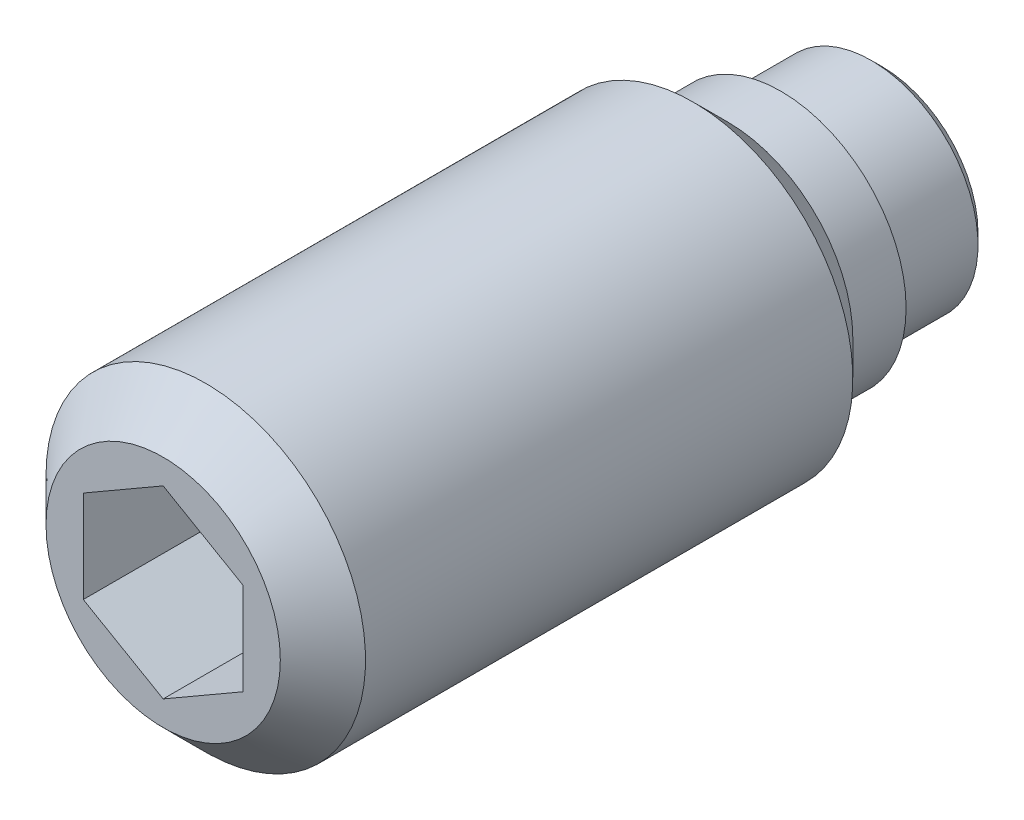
ISO-10303-21;
HEADER;
FILE_DESCRIPTION(('STEP AP214'),'2;1');
FILE_NAME('part.step','',(''),(''),'','','');
FILE_SCHEMA(('AUTOMOTIVE_DESIGN { 1 0 10303 214 1 1 1 1 }'));
ENDSEC;
DATA;
#1=APPLICATION_CONTEXT('core data for automotive mechanical design processes');
#2=APPLICATION_PROTOCOL_DEFINITION('international standard','automotive_design',2000,#1);
#3=PRODUCT_CONTEXT('',#1,'mechanical');
#4=PRODUCT('Part','Part','',(#3));
#5=PRODUCT_RELATED_PRODUCT_CATEGORY('part','',(#4));
#6=PRODUCT_DEFINITION_FORMATION('','',#4);
#7=PRODUCT_DEFINITION_CONTEXT('part definition',#1,'design');
#8=PRODUCT_DEFINITION('design','',#6,#7);
#9=PRODUCT_DEFINITION_SHAPE('','',#8);
#10=(LENGTH_UNIT() NAMED_UNIT(*) SI_UNIT(.MILLI.,.METRE.));
#11=(NAMED_UNIT(*) PLANE_ANGLE_UNIT() SI_UNIT($,.RADIAN.));
#12=(NAMED_UNIT(*) SI_UNIT($,.STERADIAN.) SOLID_ANGLE_UNIT());
#13=UNCERTAINTY_MEASURE_WITH_UNIT(LENGTH_MEASURE(1.E-05),#10,'distance_accuracy_value','');
#14=(GEOMETRIC_REPRESENTATION_CONTEXT(3) GLOBAL_UNCERTAINTY_ASSIGNED_CONTEXT((#13)) GLOBAL_UNIT_ASSIGNED_CONTEXT((#10,
#11,#12)) REPRESENTATION_CONTEXT('',''));
#15=CARTESIAN_POINT('',(0.,0.,0.));
#16=DIRECTION('',(0.,0.,1.));
#17=DIRECTION('',(1.,0.,0.));
#18=AXIS2_PLACEMENT_3D('',#15,#16,#17);
#19=CARTESIAN_POINT('',(0.,2.35,1.9));
#20=DIRECTION('',(0.,0.,1.));
#21=DIRECTION('',(1.,0.,0.));
#22=AXIS2_PLACEMENT_3D('',#19,#20,#21);
#23=PLANE('',#22);
#24=CARTESIAN_POINT('',(0.,0.,1.9));
#25=DIRECTION('',(0.,0.,-1.));
#26=DIRECTION('',(-1.,0.,0.));
#27=AXIS2_PLACEMENT_3D('',#24,#25,#26);
#28=CIRCLE('',#27,2.);
#29=CARTESIAN_POINT('',(-2.,0.,1.9));
#30=VERTEX_POINT('',#29);
#31=EDGE_CURVE('E103',#30,#30,#28,.T.);
#32=ORIENTED_EDGE('',*,*,#31,.F.);
#33=EDGE_LOOP('',(#32));
#34=FACE_BOUND('',#33,.T.);
#35=CARTESIAN_POINT('',(0.,0.,1.9));
#36=DIRECTION('',(0.,0.,-1.));
#37=DIRECTION('',(-1.,0.,0.));
#38=AXIS2_PLACEMENT_3D('',#35,#36,#37);
#39=CIRCLE('',#38,2.35);
#40=CARTESIAN_POINT('',(-2.35,0.,1.9));
#41=VERTEX_POINT('',#40);
#42=EDGE_CURVE('E123',#41,#41,#39,.T.);
#43=ORIENTED_EDGE('',*,*,#42,.T.);
#44=EDGE_LOOP('',(#43));
#45=FACE_BOUND('',#44,.T.);
#46=ADVANCED_FACE('F14',(#34,#45),#23,.F.);
#47=CARTESIAN_POINT('',(0.,0.,13.5));
#48=DIRECTION('',(0.,0.,-1.));
#49=DIRECTION('',(-1.,0.,0.));
#50=AXIS2_PLACEMENT_3D('',#47,#48,#49);
#51=PLANE('',#50);
#52=CARTESIAN_POINT('',(0.,0.,13.5));
#53=DIRECTION('',(0.,0.,-1.));
#54=DIRECTION('',(-1.,0.,0.));
#55=AXIS2_PLACEMENT_3D('',#52,#53,#54);
#56=CIRCLE('',#55,2.2);
#57=CARTESIAN_POINT('',(-2.2,0.,13.5));
#58=VERTEX_POINT('',#57);
#59=EDGE_CURVE('E9',#58,#58,#56,.T.);
#60=ORIENTED_EDGE('',*,*,#59,.F.);
#61=EDGE_LOOP('',(#60));
#62=FACE_BOUND('',#61,.T.);
#63=DIRECTION('',(0.866025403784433,-0.500000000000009,0.));
#64=VECTOR('',#63,1.);
#65=CARTESIAN_POINT('',(0.,1.7320508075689,13.5));
#66=LINE('',#65,#64);
#67=CARTESIAN_POINT('',(0.,1.7320508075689,13.5));
#68=VERTEX_POINT('',#67);
#69=CARTESIAN_POINT('',(1.5,0.86602540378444,13.5));
#70=VERTEX_POINT('',#69);
#71=EDGE_CURVE('E29',#68,#70,#66,.T.);
#72=ORIENTED_EDGE('',*,*,#71,.T.);
#73=DIRECTION('',(0.,-1.,0.));
#74=VECTOR('',#73,1.);
#75=CARTESIAN_POINT('',(1.5,0.86602540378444,13.5));
#76=LINE('',#75,#74);
#77=CARTESIAN_POINT('',(1.5,-0.86602540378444,13.5));
#78=VERTEX_POINT('',#77);
#79=EDGE_CURVE('E102',#70,#78,#76,.T.);
#80=ORIENTED_EDGE('',*,*,#79,.T.);
#81=DIRECTION('',(-0.866025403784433,-0.500000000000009,0.));
#82=VECTOR('',#81,1.);
#83=CARTESIAN_POINT('',(1.5,-0.86602540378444,13.5));
#84=LINE('',#83,#82);
#85=CARTESIAN_POINT('',(0.,-1.7320508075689,13.5));
#86=VERTEX_POINT('',#85);
#87=EDGE_CURVE('E106',#78,#86,#84,.T.);
#88=ORIENTED_EDGE('',*,*,#87,.T.);
#89=DIRECTION('',(-0.866025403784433,0.500000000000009,0.));
#90=VECTOR('',#89,1.);
#91=CARTESIAN_POINT('',(0.,-1.7320508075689,13.5));
#92=LINE('',#91,#90);
#93=CARTESIAN_POINT('',(-1.5,-0.86602540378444,13.5));
#94=VERTEX_POINT('',#93);
#95=EDGE_CURVE('E109',#86,#94,#92,.T.);
#96=ORIENTED_EDGE('',*,*,#95,.T.);
#97=DIRECTION('',(0.,1.,0.));
#98=VECTOR('',#97,1.);
#99=CARTESIAN_POINT('',(-1.5,-0.86602540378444,13.5));
#100=LINE('',#99,#98);
#101=CARTESIAN_POINT('',(-1.5,0.86602540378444,13.5));
#102=VERTEX_POINT('',#101);
#103=EDGE_CURVE('E92',#94,#102,#100,.T.);
#104=ORIENTED_EDGE('',*,*,#103,.T.);
#105=DIRECTION('',(0.866025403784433,0.500000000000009,0.));
#106=VECTOR('',#105,1.);
#107=CARTESIAN_POINT('',(-1.5,0.86602540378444,13.5));
#108=LINE('',#107,#106);
#109=EDGE_CURVE('E112',#102,#68,#108,.T.);
#110=ORIENTED_EDGE('',*,*,#109,.T.);
#111=EDGE_LOOP('',(#72,#80,#88,#96,#104,#110));
#112=FACE_BOUND('',#111,.T.);
#113=ADVANCED_FACE('F16',(#62,#112),#51,.F.);
#114=CARTESIAN_POINT('',(0.,0.,13.5));
#115=DIRECTION('',(0.,0.,-1.));
#116=DIRECTION('',(-1.,0.,0.));
#117=AXIS2_PLACEMENT_3D('',#114,#115,#116);
#118=CONICAL_SURFACE('',#117,2.2,0.785398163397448);
#119=CARTESIAN_POINT('',(0.,0.,12.7));
#120=DIRECTION('',(0.,0.,-1.));
#121=DIRECTION('',(-1.,0.,0.));
#122=AXIS2_PLACEMENT_3D('',#119,#120,#121);
#123=CIRCLE('',#122,3.);
#124=CARTESIAN_POINT('',(-3.,0.,12.7));
#125=VERTEX_POINT('',#124);
#126=EDGE_CURVE('E22',#125,#125,#123,.T.);
#127=ORIENTED_EDGE('',*,*,#126,.F.);
#128=EDGE_LOOP('',(#127));
#129=FACE_BOUND('',#128,.T.);
#130=ORIENTED_EDGE('',*,*,#59,.T.);
#131=EDGE_LOOP('',(#130));
#132=FACE_BOUND('',#131,.T.);
#133=ADVANCED_FACE('F136',(#129,#132),#118,.T.);
#134=CARTESIAN_POINT('',(0.,0.,1.9));
#135=DIRECTION('',(0.,0.,-1.));
#136=DIRECTION('',(-1.,0.,0.));
#137=AXIS2_PLACEMENT_3D('',#134,#135,#136);
#138=CYLINDRICAL_SURFACE('',#137,3.);
#139=CARTESIAN_POINT('',(0.,0.,3.55));
#140=DIRECTION('',(0.,0.,-1.));
#141=DIRECTION('',(-1.,0.,0.));
#142=AXIS2_PLACEMENT_3D('',#139,#140,#141);
#143=CIRCLE('',#142,3.);
#144=CARTESIAN_POINT('',(-3.,0.,3.55));
#145=VERTEX_POINT('',#144);
#146=EDGE_CURVE('E129',#145,#145,#143,.T.);
#147=ORIENTED_EDGE('',*,*,#146,.F.);
#148=EDGE_LOOP('',(#147));
#149=FACE_BOUND('',#148,.T.);
#150=ORIENTED_EDGE('',*,*,#126,.T.);
#151=EDGE_LOOP('',(#150));
#152=FACE_BOUND('',#151,.T.);
#153=ADVANCED_FACE('F134',(#149,#152),#138,.T.);
#154=CARTESIAN_POINT('',(0.,0.,3.55));
#155=DIRECTION('',(0.,0.,1.));
#156=DIRECTION('',(1.,0.,0.));
#157=AXIS2_PLACEMENT_3D('',#154,#155,#156);
#158=CONICAL_SURFACE('',#157,3.,0.785398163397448);
#159=CARTESIAN_POINT('',(0.,0.,2.9));
#160=DIRECTION('',(0.,0.,-1.));
#161=DIRECTION('',(-1.,0.,0.));
#162=AXIS2_PLACEMENT_3D('',#159,#160,#161);
#163=CIRCLE('',#162,2.35);
#164=CARTESIAN_POINT('',(-2.35,0.,2.9));
#165=VERTEX_POINT('',#164);
#166=EDGE_CURVE('E126',#165,#165,#163,.T.);
#167=ORIENTED_EDGE('',*,*,#166,.F.);
#168=EDGE_LOOP('',(#167));
#169=FACE_BOUND('',#168,.T.);
#170=ORIENTED_EDGE('',*,*,#146,.T.);
#171=EDGE_LOOP('',(#170));
#172=FACE_BOUND('',#171,.T.);
#173=ADVANCED_FACE('F178',(#169,#172),#158,.T.);
#174=CARTESIAN_POINT('',(0.,0.,1.9));
#175=DIRECTION('',(0.,0.,-1.));
#176=DIRECTION('',(-1.,0.,0.));
#177=AXIS2_PLACEMENT_3D('',#174,#175,#176);
#178=CYLINDRICAL_SURFACE('',#177,2.35);
#179=ORIENTED_EDGE('',*,*,#42,.F.);
#180=EDGE_LOOP('',(#179));
#181=FACE_BOUND('',#180,.T.);
#182=ORIENTED_EDGE('',*,*,#166,.T.);
#183=EDGE_LOOP('',(#182));
#184=FACE_BOUND('',#183,.T.);
#185=ADVANCED_FACE('F165',(#181,#184),#178,.T.);
#186=CARTESIAN_POINT('',(0.,1.7320508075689,10.));
#187=DIRECTION('',(-0.500000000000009,-0.866025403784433,0.));
#188=DIRECTION('',(-0.866025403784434,0.500000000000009,0.));
#189=AXIS2_PLACEMENT_3D('',#186,#187,#188);
#190=PLANE('',#189);
#191=ORIENTED_EDGE('',*,*,#71,.F.);
#192=DIRECTION('',(0.,0.,1.));
#193=VECTOR('',#192,1.);
#194=CARTESIAN_POINT('',(0.,1.7320508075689,10.));
#195=LINE('',#194,#193);
#196=CARTESIAN_POINT('',(0.,1.7320508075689,10.));
#197=VERTEX_POINT('',#196);
#198=EDGE_CURVE('E97',#197,#68,#195,.T.);
#199=ORIENTED_EDGE('',*,*,#198,.F.);
#200=DIRECTION('',(0.866025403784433,-0.500000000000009,0.));
#201=VECTOR('',#200,1.);
#202=CARTESIAN_POINT('',(0.,1.7320508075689,10.));
#203=LINE('',#202,#201);
#204=CARTESIAN_POINT('',(1.5,0.86602540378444,10.));
#205=VERTEX_POINT('',#204);
#206=EDGE_CURVE('E115',#197,#205,#203,.T.);
#207=ORIENTED_EDGE('',*,*,#206,.T.);
#208=DIRECTION('',(0.,0.,1.));
#209=VECTOR('',#208,1.);
#210=CARTESIAN_POINT('',(1.5,0.86602540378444,10.));
#211=LINE('',#210,#209);
#212=EDGE_CURVE('E121',#205,#70,#211,.T.);
#213=ORIENTED_EDGE('',*,*,#212,.T.);
#214=EDGE_LOOP('',(#191,#199,#207,#213));
#215=FACE_BOUND('',#214,.T.);
#216=ADVANCED_FACE('F144',(#215),#190,.T.);
#217=CARTESIAN_POINT('',(1.5,0.86602540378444,10.));
#218=DIRECTION('',(-1.,0.,0.));
#219=DIRECTION('',(0.,0.,1.));
#220=AXIS2_PLACEMENT_3D('',#217,#218,#219);
#221=PLANE('',#220);
#222=ORIENTED_EDGE('',*,*,#79,.F.);
#223=ORIENTED_EDGE('',*,*,#212,.F.);
#224=DIRECTION('',(0.,-1.,0.));
#225=VECTOR('',#224,1.);
#226=CARTESIAN_POINT('',(1.5,0.86602540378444,10.));
#227=LINE('',#226,#225);
#228=CARTESIAN_POINT('',(1.5,-0.86602540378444,10.));
#229=VERTEX_POINT('',#228);
#230=EDGE_CURVE('E69',#205,#229,#227,.T.);
#231=ORIENTED_EDGE('',*,*,#230,.T.);
#232=DIRECTION('',(0.,0.,1.));
#233=VECTOR('',#232,1.);
#234=CARTESIAN_POINT('',(1.5,-0.86602540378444,10.));
#235=LINE('',#234,#233);
#236=EDGE_CURVE('E119',#229,#78,#235,.T.);
#237=ORIENTED_EDGE('',*,*,#236,.T.);
#238=EDGE_LOOP('',(#222,#223,#231,#237));
#239=FACE_BOUND('',#238,.T.);
#240=ADVANCED_FACE('F155',(#239),#221,.T.);
#241=CARTESIAN_POINT('',(1.5,-0.86602540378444,10.));
#242=DIRECTION('',(-0.500000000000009,0.866025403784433,0.));
#243=DIRECTION('',(0.866025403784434,0.500000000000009,0.));
#244=AXIS2_PLACEMENT_3D('',#241,#242,#243);
#245=PLANE('',#244);
#246=ORIENTED_EDGE('',*,*,#87,.F.);
#247=ORIENTED_EDGE('',*,*,#236,.F.);
#248=DIRECTION('',(-0.866025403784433,-0.500000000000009,0.));
#249=VECTOR('',#248,1.);
#250=CARTESIAN_POINT('',(1.5,-0.86602540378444,10.));
#251=LINE('',#250,#249);
#252=CARTESIAN_POINT('',(0.,-1.7320508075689,10.));
#253=VERTEX_POINT('',#252);
#254=EDGE_CURVE('E88',#229,#253,#251,.T.);
#255=ORIENTED_EDGE('',*,*,#254,.T.);
#256=DIRECTION('',(0.,0.,1.));
#257=VECTOR('',#256,1.);
#258=CARTESIAN_POINT('',(0.,-1.7320508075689,10.));
#259=LINE('',#258,#257);
#260=EDGE_CURVE('E85',#253,#86,#259,.T.);
#261=ORIENTED_EDGE('',*,*,#260,.T.);
#262=EDGE_LOOP('',(#246,#247,#255,#261));
#263=FACE_BOUND('',#262,.T.);
#264=ADVANCED_FACE('F153',(#263),#245,.T.);
#265=CARTESIAN_POINT('',(0.,-1.7320508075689,10.));
#266=DIRECTION('',(0.500000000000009,0.866025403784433,0.));
#267=DIRECTION('',(0.866025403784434,-0.500000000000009,0.));
#268=AXIS2_PLACEMENT_3D('',#265,#266,#267);
#269=PLANE('',#268);
#270=ORIENTED_EDGE('',*,*,#95,.F.);
#271=ORIENTED_EDGE('',*,*,#260,.F.);
#272=DIRECTION('',(-0.866025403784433,0.500000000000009,0.));
#273=VECTOR('',#272,1.);
#274=CARTESIAN_POINT('',(0.,-1.7320508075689,10.));
#275=LINE('',#274,#273);
#276=CARTESIAN_POINT('',(-1.5,-0.86602540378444,10.));
#277=VERTEX_POINT('',#276);
#278=EDGE_CURVE('E80',#253,#277,#275,.T.);
#279=ORIENTED_EDGE('',*,*,#278,.T.);
#280=DIRECTION('',(0.,0.,1.));
#281=VECTOR('',#280,1.);
#282=CARTESIAN_POINT('',(-1.5,-0.86602540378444,10.));
#283=LINE('',#282,#281);
#284=EDGE_CURVE('E84',#277,#94,#283,.T.);
#285=ORIENTED_EDGE('',*,*,#284,.T.);
#286=EDGE_LOOP('',(#270,#271,#279,#285));
#287=FACE_BOUND('',#286,.T.);
#288=ADVANCED_FACE('F83',(#287),#269,.T.);
#289=CARTESIAN_POINT('',(-1.5,-0.86602540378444,10.));
#290=DIRECTION('',(1.,0.,0.));
#291=DIRECTION('',(0.,0.,-1.));
#292=AXIS2_PLACEMENT_3D('',#289,#290,#291);
#293=PLANE('',#292);
#294=ORIENTED_EDGE('',*,*,#103,.F.);
#295=ORIENTED_EDGE('',*,*,#284,.F.);
#296=DIRECTION('',(0.,1.,0.));
#297=VECTOR('',#296,1.);
#298=CARTESIAN_POINT('',(-1.5,-0.86602540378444,10.));
#299=LINE('',#298,#297);
#300=CARTESIAN_POINT('',(-1.5,0.86602540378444,10.));
#301=VERTEX_POINT('',#300);
#302=EDGE_CURVE('E87',#277,#301,#299,.T.);
#303=ORIENTED_EDGE('',*,*,#302,.T.);
#304=DIRECTION('',(0.,0.,1.));
#305=VECTOR('',#304,1.);
#306=CARTESIAN_POINT('',(-1.5,0.86602540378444,10.));
#307=LINE('',#306,#305);
#308=EDGE_CURVE('E60',#301,#102,#307,.T.);
#309=ORIENTED_EDGE('',*,*,#308,.T.);
#310=EDGE_LOOP('',(#294,#295,#303,#309));
#311=FACE_BOUND('',#310,.T.);
#312=ADVANCED_FACE('F90',(#311),#293,.T.);
#313=CARTESIAN_POINT('',(-1.5,0.86602540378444,10.));
#314=DIRECTION('',(0.500000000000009,-0.866025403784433,0.));
#315=DIRECTION('',(-0.866025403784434,-0.500000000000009,0.));
#316=AXIS2_PLACEMENT_3D('',#313,#314,#315);
#317=PLANE('',#316);
#318=ORIENTED_EDGE('',*,*,#109,.F.);
#319=ORIENTED_EDGE('',*,*,#308,.F.);
#320=DIRECTION('',(0.866025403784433,0.500000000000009,0.));
#321=VECTOR('',#320,1.);
#322=CARTESIAN_POINT('',(-1.5,0.86602540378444,10.));
#323=LINE('',#322,#321);
#324=EDGE_CURVE('E37',#301,#197,#323,.T.);
#325=ORIENTED_EDGE('',*,*,#324,.T.);
#326=ORIENTED_EDGE('',*,*,#198,.T.);
#327=EDGE_LOOP('',(#318,#319,#325,#326));
#328=FACE_BOUND('',#327,.T.);
#329=ADVANCED_FACE('F143',(#328),#317,.T.);
#330=CARTESIAN_POINT('',(0.,0.,10.));
#331=DIRECTION('',(0.,0.,-1.));
#332=DIRECTION('',(-1.,0.,0.));
#333=AXIS2_PLACEMENT_3D('',#330,#331,#332);
#334=PLANE('',#333);
#335=ORIENTED_EDGE('',*,*,#206,.F.);
#336=ORIENTED_EDGE('',*,*,#324,.F.);
#337=ORIENTED_EDGE('',*,*,#302,.F.);
#338=ORIENTED_EDGE('',*,*,#278,.F.);
#339=ORIENTED_EDGE('',*,*,#254,.F.);
#340=ORIENTED_EDGE('',*,*,#230,.F.);
#341=EDGE_LOOP('',(#335,#336,#337,#338,#339,#340));
#342=FACE_BOUND('',#341,.T.);
#343=ADVANCED_FACE('F95',(#342),#334,.F.);
#344=CARTESIAN_POINT('',(0.,0.,-0.8));
#345=DIRECTION('',(0.,0.,-1.));
#346=DIRECTION('',(-1.,0.,0.));
#347=AXIS2_PLACEMENT_3D('',#344,#345,#346);
#348=CYLINDRICAL_SURFACE('',#347,2.);
#349=CARTESIAN_POINT('',(0.,0.,0.2));
#350=DIRECTION('',(0.,0.,-1.));
#351=DIRECTION('',(-1.,0.,0.));
#352=AXIS2_PLACEMENT_3D('',#349,#350,#351);
#353=CIRCLE('',#352,2.);
#354=CARTESIAN_POINT('',(-2.,0.,0.2));
#355=VERTEX_POINT('',#354);
#356=EDGE_CURVE('E322',#355,#355,#353,.T.);
#357=ORIENTED_EDGE('',*,*,#356,.F.);
#358=EDGE_LOOP('',(#357));
#359=FACE_BOUND('',#358,.T.);
#360=ORIENTED_EDGE('',*,*,#31,.T.);
#361=EDGE_LOOP('',(#360));
#362=FACE_BOUND('',#361,.T.);
#363=ADVANCED_FACE('F263',(#359,#362),#348,.T.);
#364=CARTESIAN_POINT('',(0.,0.,0.2));
#365=DIRECTION('',(0.,0.,1.));
#366=DIRECTION('',(1.,0.,0.));
#367=AXIS2_PLACEMENT_3D('',#364,#365,#366);
#368=CONICAL_SURFACE('',#367,2.,0.785398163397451);
#369=CARTESIAN_POINT('',(0.,0.,0.));
#370=DIRECTION('',(0.,0.,-1.));
#371=DIRECTION('',(-1.,0.,0.));
#372=AXIS2_PLACEMENT_3D('',#369,#370,#371);
#373=CIRCLE('',#372,1.8);
#374=CARTESIAN_POINT('',(-1.8,0.,0.));
#375=VERTEX_POINT('',#374);
#376=EDGE_CURVE('E319',#375,#375,#373,.T.);
#377=ORIENTED_EDGE('',*,*,#376,.F.);
#378=EDGE_LOOP('',(#377));
#379=FACE_BOUND('',#378,.T.);
#380=ORIENTED_EDGE('',*,*,#356,.T.);
#381=EDGE_LOOP('',(#380));
#382=FACE_BOUND('',#381,.T.);
#383=ADVANCED_FACE('F270',(#379,#382),#368,.T.);
#384=CARTESIAN_POINT('',(0.,1.8,0.));
#385=DIRECTION('',(0.,0.,1.));
#386=DIRECTION('',(1.,0.,0.));
#387=AXIS2_PLACEMENT_3D('',#384,#385,#386);
#388=PLANE('',#387);
#389=CARTESIAN_POINT('',(0.,0.,0.));
#390=DIRECTION('',(0.,0.,-1.));
#391=DIRECTION('',(-1.,0.,0.));
#392=AXIS2_PLACEMENT_3D('',#389,#390,#391);
#393=CIRCLE('',#392,0.8);
#394=CARTESIAN_POINT('',(-0.8,0.,0.));
#395=VERTEX_POINT('',#394);
#396=EDGE_CURVE('E318',#395,#395,#393,.T.);
#397=ORIENTED_EDGE('',*,*,#396,.F.);
#398=EDGE_LOOP('',(#397));
#399=FACE_BOUND('',#398,.T.);
#400=ORIENTED_EDGE('',*,*,#376,.T.);
#401=EDGE_LOOP('',(#400));
#402=FACE_BOUND('',#401,.T.);
#403=ADVANCED_FACE('F278',(#399,#402),#388,.F.);
#404=CARTESIAN_POINT('',(0.,0.,0.));
#405=DIRECTION('',(0.,0.,1.));
#406=DIRECTION('',(1.,0.,0.));
#407=AXIS2_PLACEMENT_3D('',#404,#405,#406);
#408=CONICAL_SURFACE('',#407,0.8,0.785398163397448);
#409=CARTESIAN_POINT('',(0.,0.,-0.8));
#410=VERTEX_POINT('',#409);
#411=VERTEX_LOOP('',#410);
#412=FACE_BOUND('',#411,.T.);
#413=ORIENTED_EDGE('',*,*,#396,.T.);
#414=EDGE_LOOP('',(#413));
#415=FACE_BOUND('',#414,.T.);
#416=ADVANCED_FACE('F286',(#412,#415),#408,.T.);
#417=CLOSED_SHELL('',(#46,#113,#133,#153,#173,#185,#216,#240,#264,#288,#312,#329,#343,#363,#383,
#403,#416));
#418=MANIFOLD_SOLID_BREP('B1',#417);
#419=ADVANCED_BREP_SHAPE_REPRESENTATION('',(#18,#418),#14);
#420=SHAPE_DEFINITION_REPRESENTATION(#9,#419);
ENDSEC;
END-ISO-10303-21;
